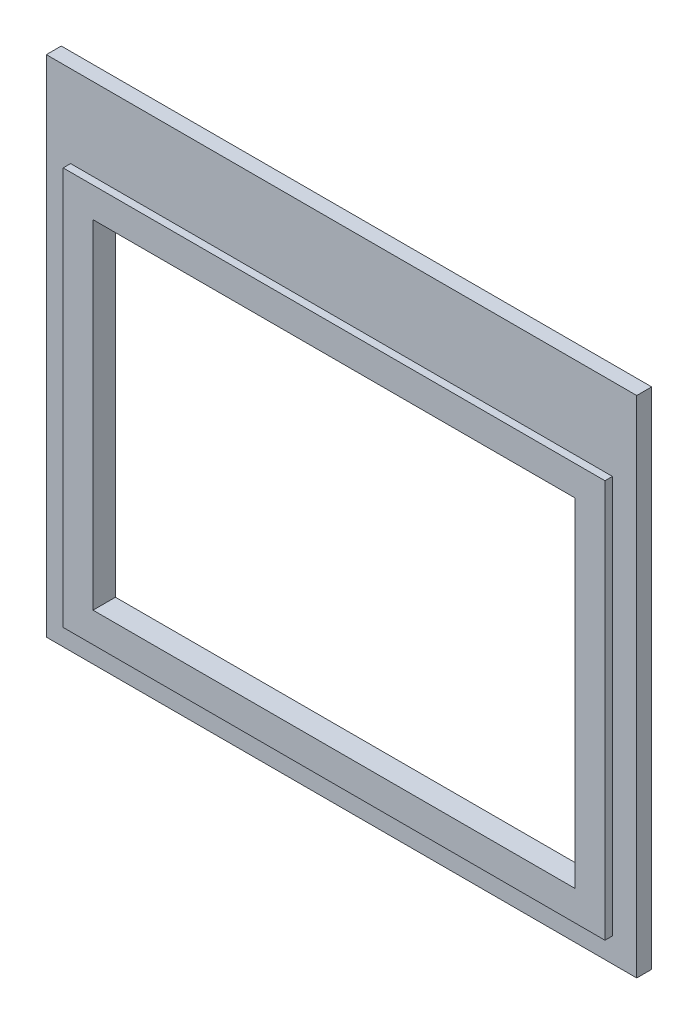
ISO-10303-21;
HEADER;
FILE_DESCRIPTION(('STEP AP214'),'2;1');
FILE_NAME('part.step','',(''),(''),'','','');
FILE_SCHEMA(('AUTOMOTIVE_DESIGN { 1 0 10303 214 1 1 1 1 }'));
ENDSEC;
DATA;
#1=APPLICATION_CONTEXT('core data for automotive mechanical design processes');
#2=APPLICATION_PROTOCOL_DEFINITION('international standard','automotive_design',2000,#1);
#3=PRODUCT_CONTEXT('',#1,'mechanical');
#4=PRODUCT('Part','Part','',(#3));
#5=PRODUCT_RELATED_PRODUCT_CATEGORY('part','',(#4));
#6=PRODUCT_DEFINITION_FORMATION('','',#4);
#7=PRODUCT_DEFINITION_CONTEXT('part definition',#1,'design');
#8=PRODUCT_DEFINITION('design','',#6,#7);
#9=PRODUCT_DEFINITION_SHAPE('','',#8);
#10=(LENGTH_UNIT() NAMED_UNIT(*) SI_UNIT(.MILLI.,.METRE.));
#11=(NAMED_UNIT(*) PLANE_ANGLE_UNIT() SI_UNIT($,.RADIAN.));
#12=(NAMED_UNIT(*) SI_UNIT($,.STERADIAN.) SOLID_ANGLE_UNIT());
#13=UNCERTAINTY_MEASURE_WITH_UNIT(LENGTH_MEASURE(1.E-05),#10,'distance_accuracy_value','');
#14=(GEOMETRIC_REPRESENTATION_CONTEXT(3) GLOBAL_UNCERTAINTY_ASSIGNED_CONTEXT((#13)) GLOBAL_UNIT_ASSIGNED_CONTEXT((#10,
#11,#12)) REPRESENTATION_CONTEXT('',''));
#15=CARTESIAN_POINT('',(0.,0.,0.));
#16=DIRECTION('',(0.,0.,1.));
#17=DIRECTION('',(1.,0.,0.));
#18=AXIS2_PLACEMENT_3D('',#15,#16,#17);
#19=CARTESIAN_POINT('',(-98.5286329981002,70.7258620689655,6.));
#20=DIRECTION('',(0.,-1.,0.));
#21=DIRECTION('',(0.,0.,-1.));
#22=AXIS2_PLACEMENT_3D('',#19,#20,#21);
#23=PLANE('',#22);
#24=DIRECTION('',(0.,0.,-1.));
#25=VECTOR('',#24,1.);
#26=CARTESIAN_POINT('',(-98.5286329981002,70.7258620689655,6.));
#27=LINE('',#26,#25);
#28=CARTESIAN_POINT('',(-98.5286329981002,70.7258620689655,4.));
#29=VERTEX_POINT('',#28);
#30=CARTESIAN_POINT('',(-98.5286329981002,70.7258620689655,0.));
#31=VERTEX_POINT('',#30);
#32=EDGE_CURVE('E204',#29,#31,#27,.T.);
#33=ORIENTED_EDGE('',*,*,#32,.F.);
#34=DIRECTION('',(-1.,0.,0.));
#35=VECTOR('',#34,1.);
#36=CARTESIAN_POINT('',(52.9713670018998,70.7258620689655,4.));
#37=LINE('',#36,#35);
#38=CARTESIAN_POINT('',(59.4713670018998,70.7258620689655,4.));
#39=VERTEX_POINT('',#38);
#40=EDGE_CURVE('E164',#39,#29,#37,.T.);
#41=ORIENTED_EDGE('',*,*,#40,.F.);
#42=DIRECTION('',(0.,0.,-1.));
#43=VECTOR('',#42,1.);
#44=CARTESIAN_POINT('',(59.4713670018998,70.7258620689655,6.));
#45=LINE('',#44,#43);
#46=CARTESIAN_POINT('',(59.4713670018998,70.7258620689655,0.));
#47=VERTEX_POINT('',#46);
#48=EDGE_CURVE('E206',#39,#47,#45,.T.);
#49=ORIENTED_EDGE('',*,*,#48,.T.);
#50=DIRECTION('',(-1.,0.,0.));
#51=VECTOR('',#50,1.);
#52=CARTESIAN_POINT('',(-98.5286329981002,70.7258620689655,0.));
#53=LINE('',#52,#51);
#54=EDGE_CURVE('E201',#47,#31,#53,.T.);
#55=ORIENTED_EDGE('',*,*,#54,.T.);
#56=EDGE_LOOP('',(#33,#41,#49,#55));
#57=FACE_BOUND('',#56,.T.);
#58=ADVANCED_FACE('F30',(#57),#23,.F.);
#59=CARTESIAN_POINT('',(-98.5286329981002,70.7258620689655,6.));
#60=DIRECTION('',(1.,0.,0.));
#61=DIRECTION('',(0.,0.,-1.));
#62=AXIS2_PLACEMENT_3D('',#59,#60,#61);
#63=PLANE('',#62);
#64=DIRECTION('',(0.,0.,-1.));
#65=VECTOR('',#64,1.);
#66=CARTESIAN_POINT('',(-98.5286329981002,-64.2741379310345,6.));
#67=LINE('',#66,#65);
#68=CARTESIAN_POINT('',(-98.5286329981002,-64.2741379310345,4.));
#69=VERTEX_POINT('',#68);
#70=CARTESIAN_POINT('',(-98.5286329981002,-64.2741379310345,0.));
#71=VERTEX_POINT('',#70);
#72=EDGE_CURVE('E11',#69,#71,#67,.T.);
#73=ORIENTED_EDGE('',*,*,#72,.F.);
#74=DIRECTION('',(0.,-1.,0.));
#75=VECTOR('',#74,1.);
#76=CARTESIAN_POINT('',(-98.5286329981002,-64.2741379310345,4.));
#77=LINE('',#76,#75);
#78=EDGE_CURVE('E175',#29,#69,#77,.T.);
#79=ORIENTED_EDGE('',*,*,#78,.F.);
#80=ORIENTED_EDGE('',*,*,#32,.T.);
#81=DIRECTION('',(0.,-1.,0.));
#82=VECTOR('',#81,1.);
#83=CARTESIAN_POINT('',(-98.5286329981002,70.7258620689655,0.));
#84=LINE('',#83,#82);
#85=EDGE_CURVE('E190',#31,#71,#84,.T.);
#86=ORIENTED_EDGE('',*,*,#85,.T.);
#87=EDGE_LOOP('',(#73,#79,#80,#86));
#88=FACE_BOUND('',#87,.T.);
#89=ADVANCED_FACE('F32',(#88),#63,.F.);
#90=CARTESIAN_POINT('',(-98.5286329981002,-64.2741379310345,6.));
#91=DIRECTION('',(0.,1.,0.));
#92=DIRECTION('',(0.,0.,1.));
#93=AXIS2_PLACEMENT_3D('',#90,#91,#92);
#94=PLANE('',#93);
#95=DIRECTION('',(0.,0.,-1.));
#96=VECTOR('',#95,1.);
#97=CARTESIAN_POINT('',(59.4713670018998,-64.2741379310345,6.));
#98=LINE('',#97,#96);
#99=CARTESIAN_POINT('',(59.4713670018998,-64.2741379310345,4.));
#100=VERTEX_POINT('',#99);
#101=CARTESIAN_POINT('',(59.4713670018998,-64.2741379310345,0.));
#102=VERTEX_POINT('',#101);
#103=EDGE_CURVE('E38',#100,#102,#98,.T.);
#104=ORIENTED_EDGE('',*,*,#103,.F.);
#105=DIRECTION('',(1.,0.,0.));
#106=VECTOR('',#105,1.);
#107=CARTESIAN_POINT('',(59.4713670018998,-64.2741379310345,4.));
#108=LINE('',#107,#106);
#109=EDGE_CURVE('E177',#69,#100,#108,.T.);
#110=ORIENTED_EDGE('',*,*,#109,.F.);
#111=ORIENTED_EDGE('',*,*,#72,.T.);
#112=DIRECTION('',(1.,0.,0.));
#113=VECTOR('',#112,1.);
#114=CARTESIAN_POINT('',(-98.5286329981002,-64.2741379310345,0.));
#115=LINE('',#114,#113);
#116=EDGE_CURVE('E195',#71,#102,#115,.T.);
#117=ORIENTED_EDGE('',*,*,#116,.T.);
#118=EDGE_LOOP('',(#104,#110,#111,#117));
#119=FACE_BOUND('',#118,.T.);
#120=ADVANCED_FACE('F217',(#119),#94,.F.);
#121=CARTESIAN_POINT('',(59.4713670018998,70.7258620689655,6.));
#122=DIRECTION('',(-1.,0.,0.));
#123=DIRECTION('',(0.,-1.,0.));
#124=AXIS2_PLACEMENT_3D('',#121,#122,#123);
#125=PLANE('',#124);
#126=ORIENTED_EDGE('',*,*,#48,.F.);
#127=DIRECTION('',(0.,1.,0.));
#128=VECTOR('',#127,1.);
#129=CARTESIAN_POINT('',(59.4713670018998,70.7258620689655,4.));
#130=LINE('',#129,#128);
#131=EDGE_CURVE('E179',#100,#39,#130,.T.);
#132=ORIENTED_EDGE('',*,*,#131,.F.);
#133=ORIENTED_EDGE('',*,*,#103,.T.);
#134=DIRECTION('',(0.,1.,0.));
#135=VECTOR('',#134,1.);
#136=CARTESIAN_POINT('',(59.4713670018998,70.7258620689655,0.));
#137=LINE('',#136,#135);
#138=EDGE_CURVE('E198',#102,#47,#137,.T.);
#139=ORIENTED_EDGE('',*,*,#138,.T.);
#140=EDGE_LOOP('',(#126,#132,#133,#139));
#141=FACE_BOUND('',#140,.T.);
#142=ADVANCED_FACE('F211',(#141),#125,.F.);
#143=CARTESIAN_POINT('',(-98.5286329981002,-64.2741379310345,6.));
#144=DIRECTION('',(0.,0.,1.));
#145=DIRECTION('',(1.,0.,0.));
#146=AXIS2_PLACEMENT_3D('',#143,#144,#145);
#147=PLANE('',#146);
#148=DIRECTION('',(0.,-1.,0.));
#149=VECTOR('',#148,1.);
#150=CARTESIAN_POINT('',(-84.0286329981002,40.7258620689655,6.));
#151=LINE('',#150,#149);
#152=CARTESIAN_POINT('',(-84.0286329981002,40.7258620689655,6.));
#153=VERTEX_POINT('',#152);
#154=CARTESIAN_POINT('',(-84.0286329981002,-49.7741379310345,6.));
#155=VERTEX_POINT('',#154);
#156=EDGE_CURVE('E45',#153,#155,#151,.T.);
#157=ORIENTED_EDGE('',*,*,#156,.F.);
#158=DIRECTION('',(-1.,0.,0.));
#159=VECTOR('',#158,1.);
#160=CARTESIAN_POINT('',(-84.0286329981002,40.7258620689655,6.));
#161=LINE('',#160,#159);
#162=CARTESIAN_POINT('',(44.9713670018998,40.7258620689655,6.));
#163=VERTEX_POINT('',#162);
#164=EDGE_CURVE('E136',#163,#153,#161,.T.);
#165=ORIENTED_EDGE('',*,*,#164,.F.);
#166=DIRECTION('',(0.,1.,0.));
#167=VECTOR('',#166,1.);
#168=CARTESIAN_POINT('',(44.9713670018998,40.7258620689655,6.));
#169=LINE('',#168,#167);
#170=CARTESIAN_POINT('',(44.9713670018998,-49.7741379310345,6.));
#171=VERTEX_POINT('',#170);
#172=EDGE_CURVE('E139',#171,#163,#169,.T.);
#173=ORIENTED_EDGE('',*,*,#172,.F.);
#174=DIRECTION('',(1.,0.,0.));
#175=VECTOR('',#174,1.);
#176=CARTESIAN_POINT('',(-84.0286329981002,-49.7741379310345,6.));
#177=LINE('',#176,#175);
#178=EDGE_CURVE('E145',#155,#171,#177,.T.);
#179=ORIENTED_EDGE('',*,*,#178,.F.);
#180=EDGE_LOOP('',(#157,#165,#173,#179));
#181=FACE_BOUND('',#180,.T.);
#182=DIRECTION('',(1.,0.,0.));
#183=VECTOR('',#182,1.);
#184=CARTESIAN_POINT('',(-92.0286329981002,48.7258620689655,6.));
#185=LINE('',#184,#183);
#186=CARTESIAN_POINT('',(-92.0286329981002,48.7258620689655,6.));
#187=VERTEX_POINT('',#186);
#188=CARTESIAN_POINT('',(52.9713670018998,48.7258620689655,6.));
#189=VERTEX_POINT('',#188);
#190=EDGE_CURVE('E151',#187,#189,#185,.T.);
#191=ORIENTED_EDGE('',*,*,#190,.F.);
#192=DIRECTION('',(0.,1.,0.));
#193=VECTOR('',#192,1.);
#194=CARTESIAN_POINT('',(-92.0286329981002,70.7258620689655,6.));
#195=LINE('',#194,#193);
#196=CARTESIAN_POINT('',(-92.0286329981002,-57.7741379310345,6.));
#197=VERTEX_POINT('',#196);
#198=EDGE_CURVE('E167',#197,#187,#195,.T.);
#199=ORIENTED_EDGE('',*,*,#198,.F.);
#200=DIRECTION('',(-1.,0.,0.));
#201=VECTOR('',#200,1.);
#202=CARTESIAN_POINT('',(-92.0286329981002,-57.7741379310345,6.));
#203=LINE('',#202,#201);
#204=CARTESIAN_POINT('',(52.9713670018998,-57.7741379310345,6.));
#205=VERTEX_POINT('',#204);
#206=EDGE_CURVE('E183',#205,#197,#203,.T.);
#207=ORIENTED_EDGE('',*,*,#206,.F.);
#208=DIRECTION('',(0.,-1.,0.));
#209=VECTOR('',#208,1.);
#210=CARTESIAN_POINT('',(52.9713670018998,-57.7741379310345,6.));
#211=LINE('',#210,#209);
#212=EDGE_CURVE('E162',#189,#205,#211,.T.);
#213=ORIENTED_EDGE('',*,*,#212,.F.);
#214=EDGE_LOOP('',(#191,#199,#207,#213));
#215=FACE_BOUND('',#214,.T.);
#216=ADVANCED_FACE('F239',(#181,#215),#147,.T.);
#217=CARTESIAN_POINT('',(-98.5286329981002,-64.2741379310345,0.));
#218=DIRECTION('',(0.,0.,1.));
#219=DIRECTION('',(1.,0.,0.));
#220=AXIS2_PLACEMENT_3D('',#217,#218,#219);
#221=PLANE('',#220);
#222=DIRECTION('',(-1.,0.,0.));
#223=VECTOR('',#222,1.);
#224=CARTESIAN_POINT('',(-84.0286329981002,40.7258620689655,0.));
#225=LINE('',#224,#223);
#226=CARTESIAN_POINT('',(44.9713670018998,40.7258620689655,0.));
#227=VERTEX_POINT('',#226);
#228=CARTESIAN_POINT('',(-84.0286329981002,40.7258620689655,0.));
#229=VERTEX_POINT('',#228);
#230=EDGE_CURVE('E126',#227,#229,#225,.T.);
#231=ORIENTED_EDGE('',*,*,#230,.T.);
#232=DIRECTION('',(0.,-1.,0.));
#233=VECTOR('',#232,1.);
#234=CARTESIAN_POINT('',(-84.0286329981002,40.7258620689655,0.));
#235=LINE('',#234,#233);
#236=CARTESIAN_POINT('',(-84.0286329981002,-49.7741379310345,0.));
#237=VERTEX_POINT('',#236);
#238=EDGE_CURVE('E120',#229,#237,#235,.T.);
#239=ORIENTED_EDGE('',*,*,#238,.T.);
#240=DIRECTION('',(1.,0.,0.));
#241=VECTOR('',#240,1.);
#242=CARTESIAN_POINT('',(-84.0286329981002,-49.7741379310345,0.));
#243=LINE('',#242,#241);
#244=CARTESIAN_POINT('',(44.9713670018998,-49.7741379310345,0.));
#245=VERTEX_POINT('',#244);
#246=EDGE_CURVE('E129',#237,#245,#243,.T.);
#247=ORIENTED_EDGE('',*,*,#246,.T.);
#248=DIRECTION('',(0.,1.,0.));
#249=VECTOR('',#248,1.);
#250=CARTESIAN_POINT('',(44.9713670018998,40.7258620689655,0.));
#251=LINE('',#250,#249);
#252=EDGE_CURVE('E53',#245,#227,#251,.T.);
#253=ORIENTED_EDGE('',*,*,#252,.T.);
#254=EDGE_LOOP('',(#231,#239,#247,#253));
#255=FACE_BOUND('',#254,.T.);
#256=ORIENTED_EDGE('',*,*,#85,.F.);
#257=ORIENTED_EDGE('',*,*,#54,.F.);
#258=ORIENTED_EDGE('',*,*,#138,.F.);
#259=ORIENTED_EDGE('',*,*,#116,.F.);
#260=EDGE_LOOP('',(#256,#257,#258,#259));
#261=FACE_BOUND('',#260,.T.);
#262=ADVANCED_FACE('F133',(#255,#261),#221,.F.);
#263=CARTESIAN_POINT('',(-92.0286329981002,70.7258620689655,4.));
#264=DIRECTION('',(1.,0.,0.));
#265=DIRECTION('',(0.,1.,0.));
#266=AXIS2_PLACEMENT_3D('',#263,#264,#265);
#267=PLANE('',#266);
#268=ORIENTED_EDGE('',*,*,#198,.T.);
#269=DIRECTION('',(0.,0.,1.));
#270=VECTOR('',#269,1.);
#271=CARTESIAN_POINT('',(-92.0286329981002,48.7258620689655,4.));
#272=LINE('',#271,#270);
#273=CARTESIAN_POINT('',(-92.0286329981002,48.7258620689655,4.));
#274=VERTEX_POINT('',#273);
#275=EDGE_CURVE('E157',#274,#187,#272,.T.);
#276=ORIENTED_EDGE('',*,*,#275,.F.);
#277=DIRECTION('',(0.,1.,0.));
#278=VECTOR('',#277,1.);
#279=CARTESIAN_POINT('',(-92.0286329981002,70.7258620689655,4.));
#280=LINE('',#279,#278);
#281=CARTESIAN_POINT('',(-92.0286329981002,-57.7741379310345,4.));
#282=VERTEX_POINT('',#281);
#283=EDGE_CURVE('E172',#282,#274,#280,.T.);
#284=ORIENTED_EDGE('',*,*,#283,.F.);
#285=DIRECTION('',(0.,0.,1.));
#286=VECTOR('',#285,1.);
#287=CARTESIAN_POINT('',(-92.0286329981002,-57.7741379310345,4.));
#288=LINE('',#287,#286);
#289=EDGE_CURVE('E188',#282,#197,#288,.T.);
#290=ORIENTED_EDGE('',*,*,#289,.T.);
#291=EDGE_LOOP('',(#268,#276,#284,#290));
#292=FACE_BOUND('',#291,.T.);
#293=ADVANCED_FACE('F247',(#292),#267,.F.);
#294=CARTESIAN_POINT('',(-92.0286329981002,-57.7741379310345,4.));
#295=DIRECTION('',(0.,1.,0.));
#296=DIRECTION('',(0.,0.,1.));
#297=AXIS2_PLACEMENT_3D('',#294,#295,#296);
#298=PLANE('',#297);
#299=ORIENTED_EDGE('',*,*,#206,.T.);
#300=ORIENTED_EDGE('',*,*,#289,.F.);
#301=DIRECTION('',(-1.,0.,0.));
#302=VECTOR('',#301,1.);
#303=CARTESIAN_POINT('',(-92.0286329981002,-57.7741379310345,4.));
#304=LINE('',#303,#302);
#305=CARTESIAN_POINT('',(52.9713670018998,-57.7741379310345,4.));
#306=VERTEX_POINT('',#305);
#307=EDGE_CURVE('E169',#306,#282,#304,.T.);
#308=ORIENTED_EDGE('',*,*,#307,.F.);
#309=DIRECTION('',(0.,0.,1.));
#310=VECTOR('',#309,1.);
#311=CARTESIAN_POINT('',(52.9713670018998,-57.7741379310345,4.));
#312=LINE('',#311,#310);
#313=EDGE_CURVE('E181',#306,#205,#312,.T.);
#314=ORIENTED_EDGE('',*,*,#313,.T.);
#315=EDGE_LOOP('',(#299,#300,#308,#314));
#316=FACE_BOUND('',#315,.T.);
#317=ADVANCED_FACE('F253',(#316),#298,.F.);
#318=CARTESIAN_POINT('',(52.9713670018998,-57.7741379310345,4.));
#319=DIRECTION('',(-1.,0.,0.));
#320=DIRECTION('',(0.,0.,1.));
#321=AXIS2_PLACEMENT_3D('',#318,#319,#320);
#322=PLANE('',#321);
#323=DIRECTION('',(0.,-1.,0.));
#324=VECTOR('',#323,1.);
#325=CARTESIAN_POINT('',(52.9713670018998,-57.7741379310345,4.));
#326=LINE('',#325,#324);
#327=CARTESIAN_POINT('',(52.9713670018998,48.7258620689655,4.));
#328=VERTEX_POINT('',#327);
#329=EDGE_CURVE('E166',#328,#306,#326,.T.);
#330=ORIENTED_EDGE('',*,*,#329,.F.);
#331=DIRECTION('',(0.,0.,1.));
#332=VECTOR('',#331,1.);
#333=CARTESIAN_POINT('',(52.9713670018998,48.7258620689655,4.));
#334=LINE('',#333,#332);
#335=EDGE_CURVE('E159',#328,#189,#334,.T.);
#336=ORIENTED_EDGE('',*,*,#335,.T.);
#337=ORIENTED_EDGE('',*,*,#212,.T.);
#338=ORIENTED_EDGE('',*,*,#313,.F.);
#339=EDGE_LOOP('',(#330,#336,#337,#338));
#340=FACE_BOUND('',#339,.T.);
#341=ADVANCED_FACE('F250',(#340),#322,.F.);
#342=CARTESIAN_POINT('',(59.4713670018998,70.7258620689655,4.));
#343=DIRECTION('',(0.,0.,-1.));
#344=DIRECTION('',(-1.,0.,0.));
#345=AXIS2_PLACEMENT_3D('',#342,#343,#344);
#346=PLANE('',#345);
#347=ORIENTED_EDGE('',*,*,#283,.T.);
#348=DIRECTION('',(1.,0.,0.));
#349=VECTOR('',#348,1.);
#350=CARTESIAN_POINT('',(-92.0286329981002,48.7258620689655,4.));
#351=LINE('',#350,#349);
#352=EDGE_CURVE('E155',#274,#328,#351,.T.);
#353=ORIENTED_EDGE('',*,*,#352,.T.);
#354=ORIENTED_EDGE('',*,*,#329,.T.);
#355=ORIENTED_EDGE('',*,*,#307,.T.);
#356=EDGE_LOOP('',(#347,#353,#354,#355));
#357=FACE_BOUND('',#356,.T.);
#358=ORIENTED_EDGE('',*,*,#40,.T.);
#359=ORIENTED_EDGE('',*,*,#78,.T.);
#360=ORIENTED_EDGE('',*,*,#109,.T.);
#361=ORIENTED_EDGE('',*,*,#131,.T.);
#362=EDGE_LOOP('',(#358,#359,#360,#361));
#363=FACE_BOUND('',#362,.T.);
#364=ADVANCED_FACE('F225',(#357,#363),#346,.F.);
#365=CARTESIAN_POINT('',(-92.0286329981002,48.7258620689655,4.));
#366=DIRECTION('',(0.,-1.,0.));
#367=DIRECTION('',(0.,0.,-1.));
#368=AXIS2_PLACEMENT_3D('',#365,#366,#367);
#369=PLANE('',#368);
#370=ORIENTED_EDGE('',*,*,#190,.T.);
#371=ORIENTED_EDGE('',*,*,#335,.F.);
#372=ORIENTED_EDGE('',*,*,#352,.F.);
#373=ORIENTED_EDGE('',*,*,#275,.T.);
#374=EDGE_LOOP('',(#370,#371,#372,#373));
#375=FACE_BOUND('',#374,.T.);
#376=ADVANCED_FACE('F263',(#375),#369,.F.);
#377=CARTESIAN_POINT('',(-84.0286329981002,40.7258620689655,0.));
#378=DIRECTION('',(-1.,0.,0.));
#379=DIRECTION('',(0.,-1.,0.));
#380=AXIS2_PLACEMENT_3D('',#377,#378,#379);
#381=PLANE('',#380);
#382=ORIENTED_EDGE('',*,*,#156,.T.);
#383=DIRECTION('',(0.,0.,1.));
#384=VECTOR('',#383,1.);
#385=CARTESIAN_POINT('',(-84.0286329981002,-49.7741379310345,0.));
#386=LINE('',#385,#384);
#387=EDGE_CURVE('E116',#237,#155,#386,.T.);
#388=ORIENTED_EDGE('',*,*,#387,.F.);
#389=ORIENTED_EDGE('',*,*,#238,.F.);
#390=DIRECTION('',(0.,0.,1.));
#391=VECTOR('',#390,1.);
#392=CARTESIAN_POINT('',(-84.0286329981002,40.7258620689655,0.));
#393=LINE('',#392,#391);
#394=EDGE_CURVE('E149',#229,#153,#393,.T.);
#395=ORIENTED_EDGE('',*,*,#394,.T.);
#396=EDGE_LOOP('',(#382,#388,#389,#395));
#397=FACE_BOUND('',#396,.T.);
#398=ADVANCED_FACE('F118',(#397),#381,.F.);
#399=CARTESIAN_POINT('',(-84.0286329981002,40.7258620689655,0.));
#400=DIRECTION('',(0.,1.,0.));
#401=DIRECTION('',(0.,0.,1.));
#402=AXIS2_PLACEMENT_3D('',#399,#400,#401);
#403=PLANE('',#402);
#404=ORIENTED_EDGE('',*,*,#164,.T.);
#405=ORIENTED_EDGE('',*,*,#394,.F.);
#406=ORIENTED_EDGE('',*,*,#230,.F.);
#407=DIRECTION('',(0.,0.,1.));
#408=VECTOR('',#407,1.);
#409=CARTESIAN_POINT('',(44.9713670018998,40.7258620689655,0.));
#410=LINE('',#409,#408);
#411=EDGE_CURVE('E152',#227,#163,#410,.T.);
#412=ORIENTED_EDGE('',*,*,#411,.T.);
#413=EDGE_LOOP('',(#404,#405,#406,#412));
#414=FACE_BOUND('',#413,.T.);
#415=ADVANCED_FACE('F270',(#414),#403,.F.);
#416=CARTESIAN_POINT('',(44.9713670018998,40.7258620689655,0.));
#417=DIRECTION('',(1.,0.,0.));
#418=DIRECTION('',(0.,0.,-1.));
#419=AXIS2_PLACEMENT_3D('',#416,#417,#418);
#420=PLANE('',#419);
#421=ORIENTED_EDGE('',*,*,#172,.T.);
#422=ORIENTED_EDGE('',*,*,#411,.F.);
#423=ORIENTED_EDGE('',*,*,#252,.F.);
#424=DIRECTION('',(0.,0.,1.));
#425=VECTOR('',#424,1.);
#426=CARTESIAN_POINT('',(44.9713670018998,-49.7741379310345,0.));
#427=LINE('',#426,#425);
#428=EDGE_CURVE('E125',#245,#171,#427,.T.);
#429=ORIENTED_EDGE('',*,*,#428,.T.);
#430=EDGE_LOOP('',(#421,#422,#423,#429));
#431=FACE_BOUND('',#430,.T.);
#432=ADVANCED_FACE('F273',(#431),#420,.F.);
#433=CARTESIAN_POINT('',(-84.0286329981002,-49.7741379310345,0.));
#434=DIRECTION('',(0.,-1.,0.));
#435=DIRECTION('',(0.,0.,-1.));
#436=AXIS2_PLACEMENT_3D('',#433,#434,#435);
#437=PLANE('',#436);
#438=ORIENTED_EDGE('',*,*,#178,.T.);
#439=ORIENTED_EDGE('',*,*,#428,.F.);
#440=ORIENTED_EDGE('',*,*,#246,.F.);
#441=ORIENTED_EDGE('',*,*,#387,.T.);
#442=EDGE_LOOP('',(#438,#439,#440,#441));
#443=FACE_BOUND('',#442,.T.);
#444=ADVANCED_FACE('F130',(#443),#437,.F.);
#445=CLOSED_SHELL('',(#58,#89,#120,#142,#216,#262,#293,#317,#341,#364,#376,#398,#415,#432,#444));
#446=MANIFOLD_SOLID_BREP('B2',#445);
#447=ADVANCED_BREP_SHAPE_REPRESENTATION('',(#18,#446),#14);
#448=SHAPE_DEFINITION_REPRESENTATION(#9,#447);
ENDSEC;
END-ISO-10303-21;
